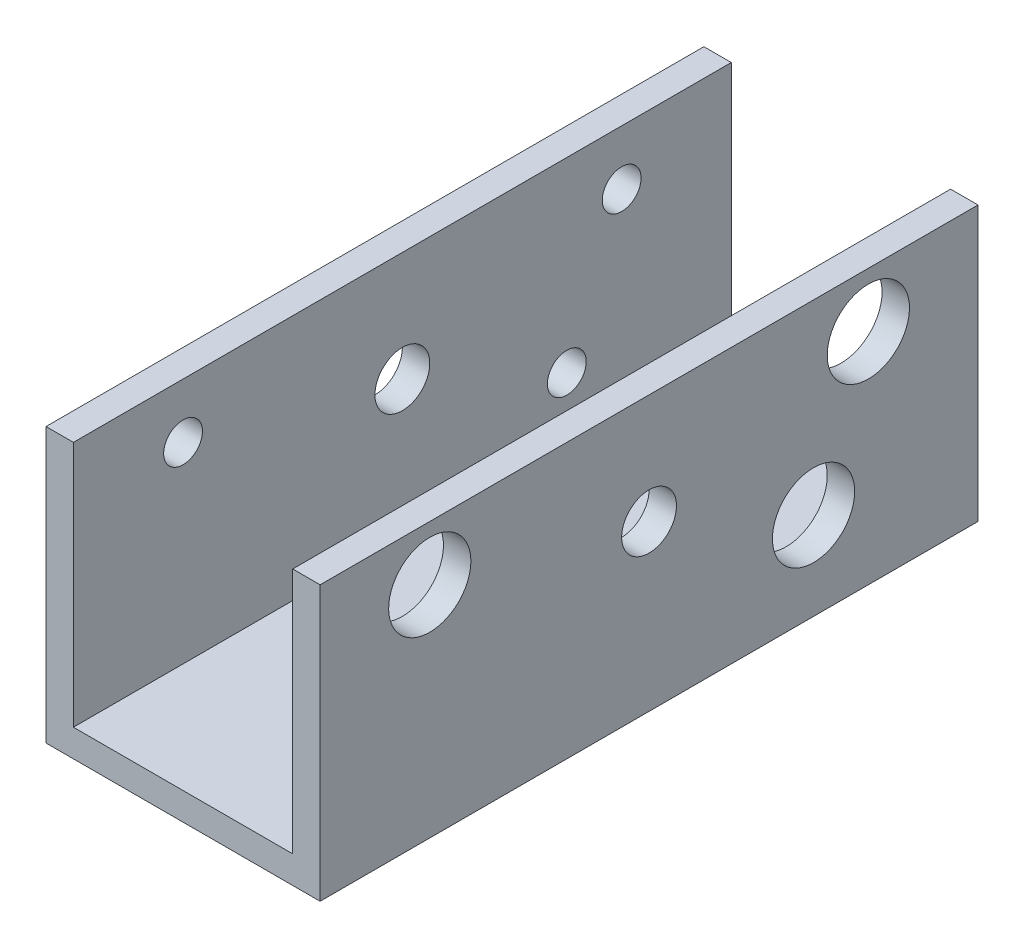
from build123d import *

# Parameters (mm, degrees)
BOSS_EXTRUDE1_DEPTH       = 76.2
CUT_EXTRUDE1_REACH        = 90.445
SKETCH2_R                 = 3.175
SKETCH2_R_2               = 4.7625
SKETCH3_R                 = 3.175
CUT_EXTRUDE2_DEPTH        = 88.355784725
F_8_CLEARANCE_HOLE1_D     = 4.4958
F_8_CLEARANCE_HOLE1_DEPTH = 31.75
F_8_CLEARANCE_HOLE1_TIP   = 1.350674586


with BuildPart() as part:
    # Sketch1 → Boss-Extrude1 (new body)
    with BuildSketch(Plane.XY):
        Polygon((0, 0), (0, 31.75), (3.175, 31.75), (3.175, 3.175), (28.575, 3.175), (28.575, 31.75), (31.75, 31.75), (31.75, 0), align=None)
    extrude(amount=BOSS_EXTRUDE1_DEPTH)

    # Sketch2 → Cut-Extrude1 (cut, up to next)
    with BuildSketch(Plane(origin=(31.75, 0, 0), x_dir=(0, 0, -1), z_dir=(1, 0, 0)), mode=Mode.PRIVATE) as cut_extrude1_sk1:
        with Locations(Location((-38.1, 19.05, 0), (0, 0, 90))):
            Circle(SKETCH2_R)
    cut_extrude1_tool1 = extrude(cut_extrude1_sk1.sketch, amount=-CUT_EXTRUDE1_REACH, mode=Mode.PRIVATE) & part.part
    # Sketch2 → Cut-Extrude1 (cut, up to next)
    with BuildSketch(Plane(origin=(31.75, 0, 0), x_dir=(0, 0, -1), z_dir=(1, 0, 0)), mode=Mode.PRIVATE) as cut_extrude1_sk2:
        with Locations(Location((-63.5, 25.4, 0), (0, 0, 90))):
            Circle(SKETCH2_R_2)
    cut_extrude1_tool2 = extrude(cut_extrude1_sk2.sketch, amount=-CUT_EXTRUDE1_REACH, mode=Mode.PRIVATE) & part.part
    # Sketch2 → Cut-Extrude1 (cut, up to next)
    with BuildSketch(Plane(origin=(31.75, 0, 0), x_dir=(0, 0, -1), z_dir=(1, 0, 0)), mode=Mode.PRIVATE) as cut_extrude1_sk3:
        with Locations(Location((-12.7, 25.4, 0), (0, 0, 90))):
            Circle(SKETCH2_R_2)
    cut_extrude1_tool3 = extrude(cut_extrude1_sk3.sketch, amount=-CUT_EXTRUDE1_REACH, mode=Mode.PRIVATE) & part.part
    # Sketch2 → Cut-Extrude1 (cut, up to next)
    with BuildSketch(Plane(origin=(31.75, 0, 0), x_dir=(0, 0, -1), z_dir=(1, 0, 0)), mode=Mode.PRIVATE) as cut_extrude1_sk4:
        with Locations(Location((-19.05, 10.16, 0), (0, 0, 90))):
            Circle(SKETCH2_R_2)
    cut_extrude1_tool4 = extrude(cut_extrude1_sk4.sketch, amount=-CUT_EXTRUDE1_REACH, mode=Mode.PRIVATE) & part.part
    add(cut_extrude1_tool1.solids().sort_by_distance((31.75, 19.05, 38.1))[0], mode=Mode.SUBTRACT)
    add(cut_extrude1_tool2.solids().sort_by_distance((31.75, 25.4, 63.5))[0], mode=Mode.SUBTRACT)
    add(cut_extrude1_tool3.solids().sort_by_distance((31.75, 25.4, 12.7))[0], mode=Mode.SUBTRACT)
    add(cut_extrude1_tool4.solids().sort_by_distance((31.75, 10.16, 19.05))[0], mode=Mode.SUBTRACT)

    # Sketch3 → Cut-Extrude2 (cut, through all)
    with BuildSketch(Plane(origin=(3.175, 0, 0), x_dir=(0, 0, -1), z_dir=(1, 0, 0))):
        with Locations(Location((-38.1, 19.05, 0), (0, 0, 90))):
            Circle(SKETCH3_R)
    extrude(amount=-CUT_EXTRUDE2_DEPTH, mode=Mode.SUBTRACT)

    # 8 Clearance Hole1
    with Locations(Plane(origin=(3.175, 0, 0), x_dir=(0, 0, -1), z_dir=(1, 0, 0))):
        with Locations((-12.7, 25.4), (-19.05, 10.16), (-63.5, 25.4)):
            Hole(F_8_CLEARANCE_HOLE1_D / 2, depth=F_8_CLEARANCE_HOLE1_DEPTH)
            with Locations((0, 0, -(F_8_CLEARANCE_HOLE1_DEPTH + F_8_CLEARANCE_HOLE1_TIP / 2))):  # 118° drill point
                Cone(0, F_8_CLEARANCE_HOLE1_D / 2, F_8_CLEARANCE_HOLE1_TIP, mode=Mode.SUBTRACT)


solid = part.part
